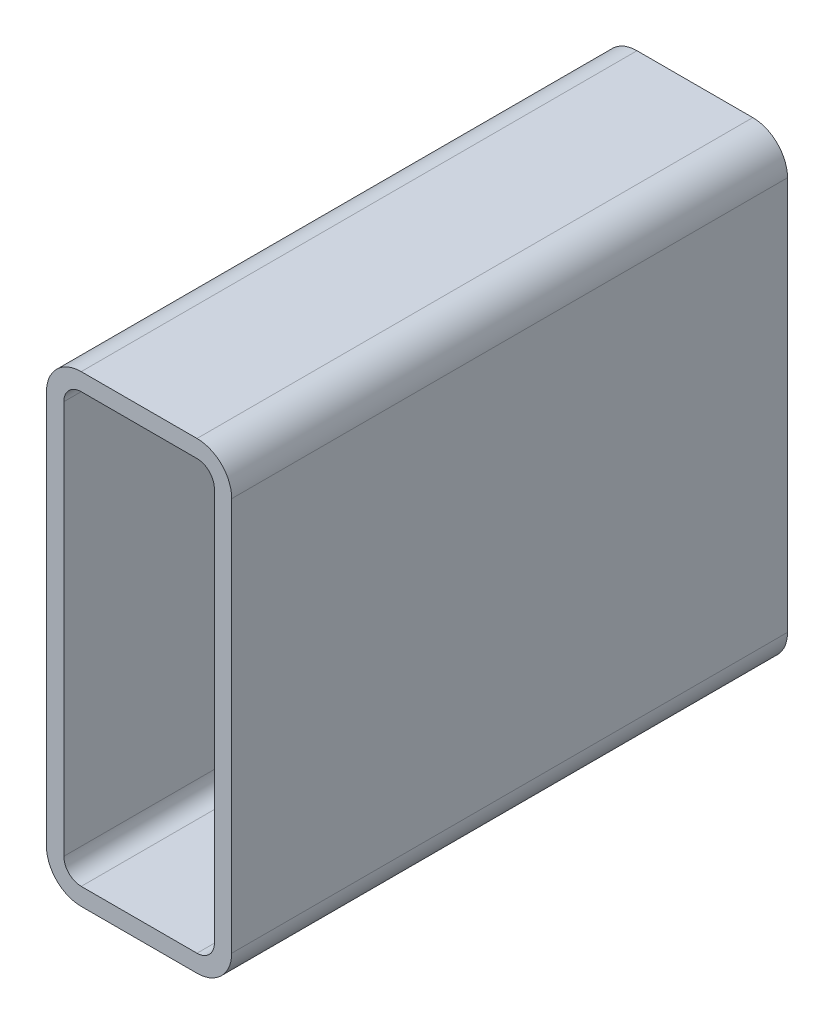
ISO-10303-21;
HEADER;
FILE_DESCRIPTION(('STEP AP214'),'2;1');
FILE_NAME('part.step','',(''),(''),'','','');
FILE_SCHEMA(('AUTOMOTIVE_DESIGN { 1 0 10303 214 1 1 1 1 }'));
ENDSEC;
DATA;
#1=APPLICATION_CONTEXT('core data for automotive mechanical design processes');
#2=APPLICATION_PROTOCOL_DEFINITION('international standard','automotive_design',2000,#1);
#3=PRODUCT_CONTEXT('',#1,'mechanical');
#4=PRODUCT('Part','Part','',(#3));
#5=PRODUCT_RELATED_PRODUCT_CATEGORY('part','',(#4));
#6=PRODUCT_DEFINITION_FORMATION('','',#4);
#7=PRODUCT_DEFINITION_CONTEXT('part definition',#1,'design');
#8=PRODUCT_DEFINITION('design','',#6,#7);
#9=PRODUCT_DEFINITION_SHAPE('','',#8);
#10=(LENGTH_UNIT() NAMED_UNIT(*) SI_UNIT(.MILLI.,.METRE.));
#11=(NAMED_UNIT(*) PLANE_ANGLE_UNIT() SI_UNIT($,.RADIAN.));
#12=(NAMED_UNIT(*) SI_UNIT($,.STERADIAN.) SOLID_ANGLE_UNIT());
#13=UNCERTAINTY_MEASURE_WITH_UNIT(LENGTH_MEASURE(1.E-05),#10,'distance_accuracy_value','');
#14=(GEOMETRIC_REPRESENTATION_CONTEXT(3) GLOBAL_UNCERTAINTY_ASSIGNED_CONTEXT((#13)) GLOBAL_UNIT_ASSIGNED_CONTEXT((#10,
#11,#12)) REPRESENTATION_CONTEXT('',''));
#15=CARTESIAN_POINT('',(0.,0.,0.));
#16=DIRECTION('',(0.,0.,1.));
#17=DIRECTION('',(1.,0.,0.));
#18=AXIS2_PLACEMENT_3D('',#15,#16,#17);
#19=CARTESIAN_POINT('',(20.7251778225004,236.870313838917,304.8));
#20=DIRECTION('',(0.,0.,1.));
#21=DIRECTION('',(1.,0.,0.));
#22=AXIS2_PLACEMENT_3D('',#19,#20,#21);
#23=PLANE('',#22);
#24=CARTESIAN_POINT('',(20.7251778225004,236.870313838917,304.8));
#25=DIRECTION('',(0.,0.,1.));
#26=DIRECTION('',(1.,0.,0.));
#27=AXIS2_PLACEMENT_3D('',#24,#25,#26);
#28=CIRCLE('',#27,19.05);
#29=CARTESIAN_POINT('',(20.7251778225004,255.920313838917,304.8));
#30=VERTEX_POINT('',#29);
#31=CARTESIAN_POINT('',(1.67517782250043,236.870313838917,304.8));
#32=VERTEX_POINT('',#31);
#33=EDGE_CURVE('E211',#30,#32,#28,.T.);
#34=ORIENTED_EDGE('',*,*,#33,.T.);
#35=DIRECTION('',(0.,-1.,0.));
#36=VECTOR('',#35,1.);
#37=CARTESIAN_POINT('',(1.67517782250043,20.9703138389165,304.8));
#38=LINE('',#37,#36);
#39=CARTESIAN_POINT('',(1.67517782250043,20.9703138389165,304.8));
#40=VERTEX_POINT('',#39);
#41=EDGE_CURVE('E214',#32,#40,#38,.T.);
#42=ORIENTED_EDGE('',*,*,#41,.T.);
#43=CARTESIAN_POINT('',(20.7251778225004,20.9703138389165,304.8));
#44=DIRECTION('',(0.,0.,1.));
#45=DIRECTION('',(1.,0.,0.));
#46=AXIS2_PLACEMENT_3D('',#43,#44,#45);
#47=CIRCLE('',#46,19.05);
#48=CARTESIAN_POINT('',(20.7251778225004,1.92031383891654,304.8));
#49=VERTEX_POINT('',#48);
#50=EDGE_CURVE('E217',#40,#49,#47,.T.);
#51=ORIENTED_EDGE('',*,*,#50,.T.);
#52=DIRECTION('',(1.,0.,0.));
#53=VECTOR('',#52,1.);
#54=CARTESIAN_POINT('',(84.2251778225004,1.92031383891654,304.8));
#55=LINE('',#54,#53);
#56=CARTESIAN_POINT('',(84.2251778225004,1.92031383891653,304.8));
#57=VERTEX_POINT('',#56);
#58=EDGE_CURVE('E219',#49,#57,#55,.T.);
#59=ORIENTED_EDGE('',*,*,#58,.T.);
#60=CARTESIAN_POINT('',(84.2251778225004,20.9703138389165,304.8));
#61=DIRECTION('',(0.,0.,1.));
#62=DIRECTION('',(1.,0.,0.));
#63=AXIS2_PLACEMENT_3D('',#60,#61,#62);
#64=CIRCLE('',#63,19.05);
#65=CARTESIAN_POINT('',(103.2751778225,20.9703138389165,304.8));
#66=VERTEX_POINT('',#65);
#67=EDGE_CURVE('E221',#57,#66,#64,.T.);
#68=ORIENTED_EDGE('',*,*,#67,.T.);
#69=DIRECTION('',(0.,1.,0.));
#70=VECTOR('',#69,1.);
#71=CARTESIAN_POINT('',(103.2751778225,236.870313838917,304.8));
#72=LINE('',#71,#70);
#73=CARTESIAN_POINT('',(103.2751778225,236.870313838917,304.8));
#74=VERTEX_POINT('',#73);
#75=EDGE_CURVE('E223',#66,#74,#72,.T.);
#76=ORIENTED_EDGE('',*,*,#75,.T.);
#77=CARTESIAN_POINT('',(84.2251778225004,236.870313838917,304.8));
#78=DIRECTION('',(0.,0.,1.));
#79=DIRECTION('',(1.,0.,0.));
#80=AXIS2_PLACEMENT_3D('',#77,#78,#79);
#81=CIRCLE('',#80,19.05);
#82=CARTESIAN_POINT('',(84.2251778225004,255.920313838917,304.8));
#83=VERTEX_POINT('',#82);
#84=EDGE_CURVE('E225',#74,#83,#81,.T.);
#85=ORIENTED_EDGE('',*,*,#84,.T.);
#86=DIRECTION('',(-1.,0.,0.));
#87=VECTOR('',#86,1.);
#88=CARTESIAN_POINT('',(20.7251778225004,255.920313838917,304.8));
#89=LINE('',#88,#87);
#90=EDGE_CURVE('E227',#83,#30,#89,.T.);
#91=ORIENTED_EDGE('',*,*,#90,.T.);
#92=EDGE_LOOP('',(#34,#42,#51,#59,#68,#76,#85,#91));
#93=FACE_BOUND('',#92,.T.);
#94=DIRECTION('',(0.,-1.,0.));
#95=VECTOR('',#94,1.);
#96=CARTESIAN_POINT('',(11.2001778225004,20.9703138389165,304.8));
#97=LINE('',#96,#95);
#98=CARTESIAN_POINT('',(11.2001778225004,236.870313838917,304.8));
#99=VERTEX_POINT('',#98);
#100=CARTESIAN_POINT('',(11.2001778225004,20.9703138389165,304.8));
#101=VERTEX_POINT('',#100);
#102=EDGE_CURVE('E154',#99,#101,#97,.T.);
#103=ORIENTED_EDGE('',*,*,#102,.F.);
#104=CARTESIAN_POINT('',(20.7251778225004,236.870313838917,304.8));
#105=DIRECTION('',(0.,0.,1.));
#106=DIRECTION('',(1.,0.,0.));
#107=AXIS2_PLACEMENT_3D('',#104,#105,#106);
#108=CIRCLE('',#107,9.52500000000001);
#109=CARTESIAN_POINT('',(20.7251778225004,246.395313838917,304.8));
#110=VERTEX_POINT('',#109);
#111=EDGE_CURVE('E146',#110,#99,#108,.T.);
#112=ORIENTED_EDGE('',*,*,#111,.F.);
#113=DIRECTION('',(-1.,0.,0.));
#114=VECTOR('',#113,1.);
#115=CARTESIAN_POINT('',(20.7251778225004,246.395313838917,304.8));
#116=LINE('',#115,#114);
#117=CARTESIAN_POINT('',(84.2251778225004,246.395313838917,304.8));
#118=VERTEX_POINT('',#117);
#119=EDGE_CURVE('E179',#118,#110,#116,.T.);
#120=ORIENTED_EDGE('',*,*,#119,.F.);
#121=CARTESIAN_POINT('',(84.2251778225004,236.870313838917,304.8));
#122=DIRECTION('',(0.,0.,1.));
#123=DIRECTION('',(1.,0.,0.));
#124=AXIS2_PLACEMENT_3D('',#121,#122,#123);
#125=CIRCLE('',#124,9.52500000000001);
#126=CARTESIAN_POINT('',(93.7501778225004,236.870313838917,304.8));
#127=VERTEX_POINT('',#126);
#128=EDGE_CURVE('E177',#127,#118,#125,.T.);
#129=ORIENTED_EDGE('',*,*,#128,.F.);
#130=DIRECTION('',(0.,1.,0.));
#131=VECTOR('',#130,1.);
#132=CARTESIAN_POINT('',(93.7501778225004,236.870313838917,304.8));
#133=LINE('',#132,#131);
#134=CARTESIAN_POINT('',(93.7501778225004,20.9703138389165,304.8));
#135=VERTEX_POINT('',#134);
#136=EDGE_CURVE('E175',#135,#127,#133,.T.);
#137=ORIENTED_EDGE('',*,*,#136,.F.);
#138=CARTESIAN_POINT('',(84.2251778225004,20.9703138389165,304.8));
#139=DIRECTION('',(0.,0.,1.));
#140=DIRECTION('',(1.,0.,0.));
#141=AXIS2_PLACEMENT_3D('',#138,#139,#140);
#142=CIRCLE('',#141,9.52500000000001);
#143=CARTESIAN_POINT('',(84.2251778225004,11.4453138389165,304.8));
#144=VERTEX_POINT('',#143);
#145=EDGE_CURVE('E173',#144,#135,#142,.T.);
#146=ORIENTED_EDGE('',*,*,#145,.F.);
#147=DIRECTION('',(1.,0.,0.));
#148=VECTOR('',#147,1.);
#149=CARTESIAN_POINT('',(84.2251778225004,11.4453138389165,304.8));
#150=LINE('',#149,#148);
#151=CARTESIAN_POINT('',(20.7251778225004,11.4453138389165,304.8));
#152=VERTEX_POINT('',#151);
#153=EDGE_CURVE('E169',#152,#144,#150,.T.);
#154=ORIENTED_EDGE('',*,*,#153,.F.);
#155=CARTESIAN_POINT('',(20.7251778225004,20.9703138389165,304.8));
#156=DIRECTION('',(0.,0.,1.));
#157=DIRECTION('',(1.,0.,0.));
#158=AXIS2_PLACEMENT_3D('',#155,#156,#157);
#159=CIRCLE('',#158,9.525);
#160=EDGE_CURVE('E167',#101,#152,#159,.T.);
#161=ORIENTED_EDGE('',*,*,#160,.F.);
#162=EDGE_LOOP('',(#103,#112,#120,#129,#137,#146,#154,#161));
#163=FACE_BOUND('',#162,.T.);
#164=ADVANCED_FACE('F33',(#93,#163),#23,.T.);
#165=CARTESIAN_POINT('',(20.7251778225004,236.870313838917,0.));
#166=DIRECTION('',(0.,0.,1.));
#167=DIRECTION('',(1.,0.,0.));
#168=AXIS2_PLACEMENT_3D('',#165,#166,#167);
#169=PLANE('',#168);
#170=CARTESIAN_POINT('',(20.7251778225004,236.870313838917,0.));
#171=DIRECTION('',(0.,0.,1.));
#172=DIRECTION('',(1.,0.,0.));
#173=AXIS2_PLACEMENT_3D('',#170,#171,#172);
#174=CIRCLE('',#173,19.05);
#175=CARTESIAN_POINT('',(20.7251778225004,255.920313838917,0.));
#176=VERTEX_POINT('',#175);
#177=CARTESIAN_POINT('',(1.67517782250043,236.870313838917,0.));
#178=VERTEX_POINT('',#177);
#179=EDGE_CURVE('E162',#176,#178,#174,.T.);
#180=ORIENTED_EDGE('',*,*,#179,.F.);
#181=DIRECTION('',(-1.,0.,0.));
#182=VECTOR('',#181,1.);
#183=CARTESIAN_POINT('',(20.7251778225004,255.920313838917,0.));
#184=LINE('',#183,#182);
#185=CARTESIAN_POINT('',(84.2251778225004,255.920313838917,0.));
#186=VERTEX_POINT('',#185);
#187=EDGE_CURVE('E215',#186,#176,#184,.T.);
#188=ORIENTED_EDGE('',*,*,#187,.F.);
#189=CARTESIAN_POINT('',(84.2251778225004,236.870313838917,0.));
#190=DIRECTION('',(0.,0.,1.));
#191=DIRECTION('',(1.,0.,0.));
#192=AXIS2_PLACEMENT_3D('',#189,#190,#191);
#193=CIRCLE('',#192,19.05);
#194=CARTESIAN_POINT('',(103.2751778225,236.870313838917,0.));
#195=VERTEX_POINT('',#194);
#196=EDGE_CURVE('E242',#195,#186,#193,.T.);
#197=ORIENTED_EDGE('',*,*,#196,.F.);
#198=DIRECTION('',(0.,1.,0.));
#199=VECTOR('',#198,1.);
#200=CARTESIAN_POINT('',(103.2751778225,236.870313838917,0.));
#201=LINE('',#200,#199);
#202=CARTESIAN_POINT('',(103.2751778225,20.9703138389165,0.));
#203=VERTEX_POINT('',#202);
#204=EDGE_CURVE('E240',#203,#195,#201,.T.);
#205=ORIENTED_EDGE('',*,*,#204,.F.);
#206=CARTESIAN_POINT('',(84.2251778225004,20.9703138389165,0.));
#207=DIRECTION('',(0.,0.,1.));
#208=DIRECTION('',(1.,0.,0.));
#209=AXIS2_PLACEMENT_3D('',#206,#207,#208);
#210=CIRCLE('',#209,19.05);
#211=CARTESIAN_POINT('',(84.2251778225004,1.92031383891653,0.));
#212=VERTEX_POINT('',#211);
#213=EDGE_CURVE('E238',#212,#203,#210,.T.);
#214=ORIENTED_EDGE('',*,*,#213,.F.);
#215=DIRECTION('',(1.,0.,0.));
#216=VECTOR('',#215,1.);
#217=CARTESIAN_POINT('',(84.2251778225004,1.92031383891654,0.));
#218=LINE('',#217,#216);
#219=CARTESIAN_POINT('',(20.7251778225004,1.92031383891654,0.));
#220=VERTEX_POINT('',#219);
#221=EDGE_CURVE('E236',#220,#212,#218,.T.);
#222=ORIENTED_EDGE('',*,*,#221,.F.);
#223=CARTESIAN_POINT('',(20.7251778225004,20.9703138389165,0.));
#224=DIRECTION('',(0.,0.,1.));
#225=DIRECTION('',(1.,0.,0.));
#226=AXIS2_PLACEMENT_3D('',#223,#224,#225);
#227=CIRCLE('',#226,19.05);
#228=CARTESIAN_POINT('',(1.67517782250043,20.9703138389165,0.));
#229=VERTEX_POINT('',#228);
#230=EDGE_CURVE('E234',#229,#220,#227,.T.);
#231=ORIENTED_EDGE('',*,*,#230,.F.);
#232=DIRECTION('',(0.,-1.,0.));
#233=VECTOR('',#232,1.);
#234=CARTESIAN_POINT('',(1.67517782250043,20.9703138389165,0.));
#235=LINE('',#234,#233);
#236=EDGE_CURVE('E232',#178,#229,#235,.T.);
#237=ORIENTED_EDGE('',*,*,#236,.F.);
#238=EDGE_LOOP('',(#180,#188,#197,#205,#214,#222,#231,#237));
#239=FACE_BOUND('',#238,.T.);
#240=CARTESIAN_POINT('',(20.7251778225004,236.870313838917,0.));
#241=DIRECTION('',(0.,0.,1.));
#242=DIRECTION('',(1.,0.,0.));
#243=AXIS2_PLACEMENT_3D('',#240,#241,#242);
#244=CIRCLE('',#243,9.52500000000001);
#245=CARTESIAN_POINT('',(20.7251778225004,246.395313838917,0.));
#246=VERTEX_POINT('',#245);
#247=CARTESIAN_POINT('',(11.2001778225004,236.870313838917,0.));
#248=VERTEX_POINT('',#247);
#249=EDGE_CURVE('E56',#246,#248,#244,.T.);
#250=ORIENTED_EDGE('',*,*,#249,.T.);
#251=DIRECTION('',(0.,-1.,0.));
#252=VECTOR('',#251,1.);
#253=CARTESIAN_POINT('',(11.2001778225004,20.9703138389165,0.));
#254=LINE('',#253,#252);
#255=CARTESIAN_POINT('',(11.2001778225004,20.9703138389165,0.));
#256=VERTEX_POINT('',#255);
#257=EDGE_CURVE('E161',#248,#256,#254,.T.);
#258=ORIENTED_EDGE('',*,*,#257,.T.);
#259=CARTESIAN_POINT('',(20.7251778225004,20.9703138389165,0.));
#260=DIRECTION('',(0.,0.,1.));
#261=DIRECTION('',(1.,0.,0.));
#262=AXIS2_PLACEMENT_3D('',#259,#260,#261);
#263=CIRCLE('',#262,9.525);
#264=CARTESIAN_POINT('',(20.7251778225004,11.4453138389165,0.));
#265=VERTEX_POINT('',#264);
#266=EDGE_CURVE('E183',#256,#265,#263,.T.);
#267=ORIENTED_EDGE('',*,*,#266,.T.);
#268=DIRECTION('',(1.,0.,0.));
#269=VECTOR('',#268,1.);
#270=CARTESIAN_POINT('',(84.2251778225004,11.4453138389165,0.));
#271=LINE('',#270,#269);
#272=CARTESIAN_POINT('',(84.2251778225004,11.4453138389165,0.));
#273=VERTEX_POINT('',#272);
#274=EDGE_CURVE('E186',#265,#273,#271,.T.);
#275=ORIENTED_EDGE('',*,*,#274,.T.);
#276=CARTESIAN_POINT('',(84.2251778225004,20.9703138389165,0.));
#277=DIRECTION('',(0.,0.,1.));
#278=DIRECTION('',(1.,0.,0.));
#279=AXIS2_PLACEMENT_3D('',#276,#277,#278);
#280=CIRCLE('',#279,9.52500000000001);
#281=CARTESIAN_POINT('',(93.7501778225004,20.9703138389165,0.));
#282=VERTEX_POINT('',#281);
#283=EDGE_CURVE('E189',#273,#282,#280,.T.);
#284=ORIENTED_EDGE('',*,*,#283,.T.);
#285=DIRECTION('',(0.,1.,0.));
#286=VECTOR('',#285,1.);
#287=CARTESIAN_POINT('',(93.7501778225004,236.870313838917,0.));
#288=LINE('',#287,#286);
#289=CARTESIAN_POINT('',(93.7501778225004,236.870313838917,0.));
#290=VERTEX_POINT('',#289);
#291=EDGE_CURVE('E192',#282,#290,#288,.T.);
#292=ORIENTED_EDGE('',*,*,#291,.T.);
#293=CARTESIAN_POINT('',(84.2251778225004,236.870313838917,0.));
#294=DIRECTION('',(0.,0.,1.));
#295=DIRECTION('',(1.,0.,0.));
#296=AXIS2_PLACEMENT_3D('',#293,#294,#295);
#297=CIRCLE('',#296,9.52500000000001);
#298=CARTESIAN_POINT('',(84.2251778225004,246.395313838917,0.));
#299=VERTEX_POINT('',#298);
#300=EDGE_CURVE('E195',#290,#299,#297,.T.);
#301=ORIENTED_EDGE('',*,*,#300,.T.);
#302=DIRECTION('',(-1.,0.,0.));
#303=VECTOR('',#302,1.);
#304=CARTESIAN_POINT('',(20.7251778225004,246.395313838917,0.));
#305=LINE('',#304,#303);
#306=EDGE_CURVE('E155',#299,#246,#305,.T.);
#307=ORIENTED_EDGE('',*,*,#306,.T.);
#308=EDGE_LOOP('',(#250,#258,#267,#275,#284,#292,#301,#307));
#309=FACE_BOUND('',#308,.T.);
#310=ADVANCED_FACE('F272',(#239,#309),#169,.F.);
#311=CARTESIAN_POINT('',(20.7251778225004,236.870313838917,304.8));
#312=DIRECTION('',(0.,0.,-1.));
#313=DIRECTION('',(-1.,0.,0.));
#314=AXIS2_PLACEMENT_3D('',#311,#312,#313);
#315=CYLINDRICAL_SURFACE('',#314,19.05);
#316=ORIENTED_EDGE('',*,*,#179,.T.);
#317=DIRECTION('',(0.,0.,-1.));
#318=VECTOR('',#317,1.);
#319=CARTESIAN_POINT('',(1.67517782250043,236.870313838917,304.8));
#320=LINE('',#319,#318);
#321=EDGE_CURVE('E11',#32,#178,#320,.T.);
#322=ORIENTED_EDGE('',*,*,#321,.F.);
#323=ORIENTED_EDGE('',*,*,#33,.F.);
#324=DIRECTION('',(0.,0.,-1.));
#325=VECTOR('',#324,1.);
#326=CARTESIAN_POINT('',(20.7251778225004,255.920313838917,304.8));
#327=LINE('',#326,#325);
#328=EDGE_CURVE('E229',#30,#176,#327,.T.);
#329=ORIENTED_EDGE('',*,*,#328,.T.);
#330=EDGE_LOOP('',(#316,#322,#323,#329));
#331=FACE_BOUND('',#330,.T.);
#332=ADVANCED_FACE('F35',(#331),#315,.T.);
#333=CARTESIAN_POINT('',(1.67517782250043,20.9703138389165,304.8));
#334=DIRECTION('',(1.,0.,0.));
#335=DIRECTION('',(0.,0.,-1.));
#336=AXIS2_PLACEMENT_3D('',#333,#334,#335);
#337=PLANE('',#336);
#338=ORIENTED_EDGE('',*,*,#236,.T.);
#339=DIRECTION('',(0.,0.,-1.));
#340=VECTOR('',#339,1.);
#341=CARTESIAN_POINT('',(1.67517782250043,20.9703138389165,304.8));
#342=LINE('',#341,#340);
#343=EDGE_CURVE('E41',#40,#229,#342,.T.);
#344=ORIENTED_EDGE('',*,*,#343,.F.);
#345=ORIENTED_EDGE('',*,*,#41,.F.);
#346=ORIENTED_EDGE('',*,*,#321,.T.);
#347=EDGE_LOOP('',(#338,#344,#345,#346));
#348=FACE_BOUND('',#347,.T.);
#349=ADVANCED_FACE('F289',(#348),#337,.F.);
#350=CARTESIAN_POINT('',(20.7251778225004,20.9703138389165,304.8));
#351=DIRECTION('',(0.,0.,-1.));
#352=DIRECTION('',(-1.,0.,0.));
#353=AXIS2_PLACEMENT_3D('',#350,#351,#352);
#354=CYLINDRICAL_SURFACE('',#353,19.05);
#355=ORIENTED_EDGE('',*,*,#230,.T.);
#356=DIRECTION('',(0.,0.,-1.));
#357=VECTOR('',#356,1.);
#358=CARTESIAN_POINT('',(20.7251778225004,1.92031383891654,304.8));
#359=LINE('',#358,#357);
#360=EDGE_CURVE('E259',#49,#220,#359,.T.);
#361=ORIENTED_EDGE('',*,*,#360,.F.);
#362=ORIENTED_EDGE('',*,*,#50,.F.);
#363=ORIENTED_EDGE('',*,*,#343,.T.);
#364=EDGE_LOOP('',(#355,#361,#362,#363));
#365=FACE_BOUND('',#364,.T.);
#366=ADVANCED_FACE('F266',(#365),#354,.T.);
#367=CARTESIAN_POINT('',(84.2251778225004,1.92031383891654,304.8));
#368=DIRECTION('',(0.,1.,0.));
#369=DIRECTION('',(0.,0.,1.));
#370=AXIS2_PLACEMENT_3D('',#367,#368,#369);
#371=PLANE('',#370);
#372=ORIENTED_EDGE('',*,*,#221,.T.);
#373=DIRECTION('',(0.,0.,-1.));
#374=VECTOR('',#373,1.);
#375=CARTESIAN_POINT('',(84.2251778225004,1.92031383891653,304.8));
#376=LINE('',#375,#374);
#377=EDGE_CURVE('E256',#57,#212,#376,.T.);
#378=ORIENTED_EDGE('',*,*,#377,.F.);
#379=ORIENTED_EDGE('',*,*,#58,.F.);
#380=ORIENTED_EDGE('',*,*,#360,.T.);
#381=EDGE_LOOP('',(#372,#378,#379,#380));
#382=FACE_BOUND('',#381,.T.);
#383=ADVANCED_FACE('F278',(#382),#371,.F.);
#384=CARTESIAN_POINT('',(84.2251778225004,20.9703138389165,304.8));
#385=DIRECTION('',(0.,0.,-1.));
#386=DIRECTION('',(-1.,0.,0.));
#387=AXIS2_PLACEMENT_3D('',#384,#385,#386);
#388=CYLINDRICAL_SURFACE('',#387,19.05);
#389=ORIENTED_EDGE('',*,*,#213,.T.);
#390=DIRECTION('',(0.,0.,-1.));
#391=VECTOR('',#390,1.);
#392=CARTESIAN_POINT('',(103.2751778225,20.9703138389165,304.8));
#393=LINE('',#392,#391);
#394=EDGE_CURVE('E253',#66,#203,#393,.T.);
#395=ORIENTED_EDGE('',*,*,#394,.F.);
#396=ORIENTED_EDGE('',*,*,#67,.F.);
#397=ORIENTED_EDGE('',*,*,#377,.T.);
#398=EDGE_LOOP('',(#389,#395,#396,#397));
#399=FACE_BOUND('',#398,.T.);
#400=ADVANCED_FACE('F282',(#399),#388,.T.);
#401=CARTESIAN_POINT('',(103.2751778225,236.870313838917,304.8));
#402=DIRECTION('',(-1.,0.,0.));
#403=DIRECTION('',(0.,0.,1.));
#404=AXIS2_PLACEMENT_3D('',#401,#402,#403);
#405=PLANE('',#404);
#406=ORIENTED_EDGE('',*,*,#204,.T.);
#407=DIRECTION('',(0.,0.,-1.));
#408=VECTOR('',#407,1.);
#409=CARTESIAN_POINT('',(103.2751778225,236.870313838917,304.8));
#410=LINE('',#409,#408);
#411=EDGE_CURVE('E250',#74,#195,#410,.T.);
#412=ORIENTED_EDGE('',*,*,#411,.F.);
#413=ORIENTED_EDGE('',*,*,#75,.F.);
#414=ORIENTED_EDGE('',*,*,#394,.T.);
#415=EDGE_LOOP('',(#406,#412,#413,#414));
#416=FACE_BOUND('',#415,.T.);
#417=ADVANCED_FACE('F302',(#416),#405,.F.);
#418=CARTESIAN_POINT('',(84.2251778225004,236.870313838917,304.8));
#419=DIRECTION('',(0.,0.,-1.));
#420=DIRECTION('',(-1.,0.,0.));
#421=AXIS2_PLACEMENT_3D('',#418,#419,#420);
#422=CYLINDRICAL_SURFACE('',#421,19.05);
#423=ORIENTED_EDGE('',*,*,#196,.T.);
#424=DIRECTION('',(0.,0.,-1.));
#425=VECTOR('',#424,1.);
#426=CARTESIAN_POINT('',(84.2251778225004,255.920313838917,304.8));
#427=LINE('',#426,#425);
#428=EDGE_CURVE('E247',#83,#186,#427,.T.);
#429=ORIENTED_EDGE('',*,*,#428,.F.);
#430=ORIENTED_EDGE('',*,*,#84,.F.);
#431=ORIENTED_EDGE('',*,*,#411,.T.);
#432=EDGE_LOOP('',(#423,#429,#430,#431));
#433=FACE_BOUND('',#432,.T.);
#434=ADVANCED_FACE('F300',(#433),#422,.T.);
#435=CARTESIAN_POINT('',(20.7251778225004,255.920313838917,304.8));
#436=DIRECTION('',(0.,-1.,0.));
#437=DIRECTION('',(0.,0.,-1.));
#438=AXIS2_PLACEMENT_3D('',#435,#436,#437);
#439=PLANE('',#438);
#440=ORIENTED_EDGE('',*,*,#187,.T.);
#441=ORIENTED_EDGE('',*,*,#328,.F.);
#442=ORIENTED_EDGE('',*,*,#90,.F.);
#443=ORIENTED_EDGE('',*,*,#428,.T.);
#444=EDGE_LOOP('',(#440,#441,#442,#443));
#445=FACE_BOUND('',#444,.T.);
#446=ADVANCED_FACE('F295',(#445),#439,.F.);
#447=CARTESIAN_POINT('',(20.7251778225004,236.870313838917,304.8));
#448=DIRECTION('',(0.,0.,-1.));
#449=DIRECTION('',(-1.,0.,0.));
#450=AXIS2_PLACEMENT_3D('',#447,#448,#449);
#451=CYLINDRICAL_SURFACE('',#450,9.52500000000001);
#452=ORIENTED_EDGE('',*,*,#249,.F.);
#453=DIRECTION('',(0.,0.,-1.));
#454=VECTOR('',#453,1.);
#455=CARTESIAN_POINT('',(20.7251778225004,246.395313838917,304.8));
#456=LINE('',#455,#454);
#457=EDGE_CURVE('E150',#110,#246,#456,.T.);
#458=ORIENTED_EDGE('',*,*,#457,.F.);
#459=ORIENTED_EDGE('',*,*,#111,.T.);
#460=DIRECTION('',(0.,0.,-1.));
#461=VECTOR('',#460,1.);
#462=CARTESIAN_POINT('',(11.2001778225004,236.870313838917,304.8));
#463=LINE('',#462,#461);
#464=EDGE_CURVE('E149',#99,#248,#463,.T.);
#465=ORIENTED_EDGE('',*,*,#464,.T.);
#466=EDGE_LOOP('',(#452,#458,#459,#465));
#467=FACE_BOUND('',#466,.T.);
#468=ADVANCED_FACE('F148',(#467),#451,.F.);
#469=CARTESIAN_POINT('',(11.2001778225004,20.9703138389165,304.8));
#470=DIRECTION('',(1.,0.,0.));
#471=DIRECTION('',(0.,0.,-1.));
#472=AXIS2_PLACEMENT_3D('',#469,#470,#471);
#473=PLANE('',#472);
#474=ORIENTED_EDGE('',*,*,#257,.F.);
#475=ORIENTED_EDGE('',*,*,#464,.F.);
#476=ORIENTED_EDGE('',*,*,#102,.T.);
#477=DIRECTION('',(0.,0.,-1.));
#478=VECTOR('',#477,1.);
#479=CARTESIAN_POINT('',(11.2001778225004,20.9703138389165,304.8));
#480=LINE('',#479,#478);
#481=EDGE_CURVE('E163',#101,#256,#480,.T.);
#482=ORIENTED_EDGE('',*,*,#481,.T.);
#483=EDGE_LOOP('',(#474,#475,#476,#482));
#484=FACE_BOUND('',#483,.T.);
#485=ADVANCED_FACE('F158',(#484),#473,.T.);
#486=CARTESIAN_POINT('',(20.7251778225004,20.9703138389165,304.8));
#487=DIRECTION('',(0.,0.,-1.));
#488=DIRECTION('',(-1.,0.,0.));
#489=AXIS2_PLACEMENT_3D('',#486,#487,#488);
#490=CYLINDRICAL_SURFACE('',#489,9.525);
#491=ORIENTED_EDGE('',*,*,#266,.F.);
#492=ORIENTED_EDGE('',*,*,#481,.F.);
#493=ORIENTED_EDGE('',*,*,#160,.T.);
#494=DIRECTION('',(0.,0.,-1.));
#495=VECTOR('',#494,1.);
#496=CARTESIAN_POINT('',(20.7251778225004,11.4453138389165,304.8));
#497=LINE('',#496,#495);
#498=EDGE_CURVE('E208',#152,#265,#497,.T.);
#499=ORIENTED_EDGE('',*,*,#498,.T.);
#500=EDGE_LOOP('',(#491,#492,#493,#499));
#501=FACE_BOUND('',#500,.T.);
#502=ADVANCED_FACE('F327',(#501),#490,.F.);
#503=CARTESIAN_POINT('',(84.2251778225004,11.4453138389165,304.8));
#504=DIRECTION('',(0.,1.,0.));
#505=DIRECTION('',(0.,0.,1.));
#506=AXIS2_PLACEMENT_3D('',#503,#504,#505);
#507=PLANE('',#506);
#508=ORIENTED_EDGE('',*,*,#274,.F.);
#509=ORIENTED_EDGE('',*,*,#498,.F.);
#510=ORIENTED_EDGE('',*,*,#153,.T.);
#511=DIRECTION('',(0.,0.,-1.));
#512=VECTOR('',#511,1.);
#513=CARTESIAN_POINT('',(84.2251778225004,11.4453138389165,304.8));
#514=LINE('',#513,#512);
#515=EDGE_CURVE('E206',#144,#273,#514,.T.);
#516=ORIENTED_EDGE('',*,*,#515,.T.);
#517=EDGE_LOOP('',(#508,#509,#510,#516));
#518=FACE_BOUND('',#517,.T.);
#519=ADVANCED_FACE('F331',(#518),#507,.T.);
#520=CARTESIAN_POINT('',(84.2251778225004,20.9703138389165,304.8));
#521=DIRECTION('',(0.,0.,-1.));
#522=DIRECTION('',(-1.,0.,0.));
#523=AXIS2_PLACEMENT_3D('',#520,#521,#522);
#524=CYLINDRICAL_SURFACE('',#523,9.52500000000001);
#525=ORIENTED_EDGE('',*,*,#283,.F.);
#526=ORIENTED_EDGE('',*,*,#515,.F.);
#527=ORIENTED_EDGE('',*,*,#145,.T.);
#528=DIRECTION('',(0.,0.,-1.));
#529=VECTOR('',#528,1.);
#530=CARTESIAN_POINT('',(93.7501778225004,20.9703138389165,304.8));
#531=LINE('',#530,#529);
#532=EDGE_CURVE('E204',#135,#282,#531,.T.);
#533=ORIENTED_EDGE('',*,*,#532,.T.);
#534=EDGE_LOOP('',(#525,#526,#527,#533));
#535=FACE_BOUND('',#534,.T.);
#536=ADVANCED_FACE('F337',(#535),#524,.F.);
#537=CARTESIAN_POINT('',(93.7501778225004,236.870313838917,304.8));
#538=DIRECTION('',(-1.,0.,0.));
#539=DIRECTION('',(0.,0.,1.));
#540=AXIS2_PLACEMENT_3D('',#537,#538,#539);
#541=PLANE('',#540);
#542=ORIENTED_EDGE('',*,*,#291,.F.);
#543=ORIENTED_EDGE('',*,*,#532,.F.);
#544=ORIENTED_EDGE('',*,*,#136,.T.);
#545=DIRECTION('',(0.,0.,-1.));
#546=VECTOR('',#545,1.);
#547=CARTESIAN_POINT('',(93.7501778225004,236.870313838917,304.8));
#548=LINE('',#547,#546);
#549=EDGE_CURVE('E202',#127,#290,#548,.T.);
#550=ORIENTED_EDGE('',*,*,#549,.T.);
#551=EDGE_LOOP('',(#542,#543,#544,#550));
#552=FACE_BOUND('',#551,.T.);
#553=ADVANCED_FACE('F341',(#552),#541,.T.);
#554=CARTESIAN_POINT('',(84.2251778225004,236.870313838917,304.8));
#555=DIRECTION('',(0.,0.,-1.));
#556=DIRECTION('',(-1.,0.,0.));
#557=AXIS2_PLACEMENT_3D('',#554,#555,#556);
#558=CYLINDRICAL_SURFACE('',#557,9.52500000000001);
#559=ORIENTED_EDGE('',*,*,#300,.F.);
#560=ORIENTED_EDGE('',*,*,#549,.F.);
#561=ORIENTED_EDGE('',*,*,#128,.T.);
#562=DIRECTION('',(0.,0.,-1.));
#563=VECTOR('',#562,1.);
#564=CARTESIAN_POINT('',(84.2251778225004,246.395313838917,304.8));
#565=LINE('',#564,#563);
#566=EDGE_CURVE('E48',#118,#299,#565,.T.);
#567=ORIENTED_EDGE('',*,*,#566,.T.);
#568=EDGE_LOOP('',(#559,#560,#561,#567));
#569=FACE_BOUND('',#568,.T.);
#570=ADVANCED_FACE('F345',(#569),#558,.F.);
#571=CARTESIAN_POINT('',(20.7251778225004,246.395313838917,304.8));
#572=DIRECTION('',(0.,-1.,0.));
#573=DIRECTION('',(0.,0.,-1.));
#574=AXIS2_PLACEMENT_3D('',#571,#572,#573);
#575=PLANE('',#574);
#576=ORIENTED_EDGE('',*,*,#306,.F.);
#577=ORIENTED_EDGE('',*,*,#566,.F.);
#578=ORIENTED_EDGE('',*,*,#119,.T.);
#579=ORIENTED_EDGE('',*,*,#457,.T.);
#580=EDGE_LOOP('',(#576,#577,#578,#579));
#581=FACE_BOUND('',#580,.T.);
#582=ADVANCED_FACE('F349',(#581),#575,.T.);
#583=CLOSED_SHELL('',(#164,#310,#332,#349,#366,#383,#400,#417,#434,#446,#468,#485,#502,#519,
#536,#553,#570,#582));
#584=MANIFOLD_SOLID_BREP('B2',#583);
#585=ADVANCED_BREP_SHAPE_REPRESENTATION('',(#18,#584),#14);
#586=SHAPE_DEFINITION_REPRESENTATION(#9,#585);
ENDSEC;
END-ISO-10303-21;
